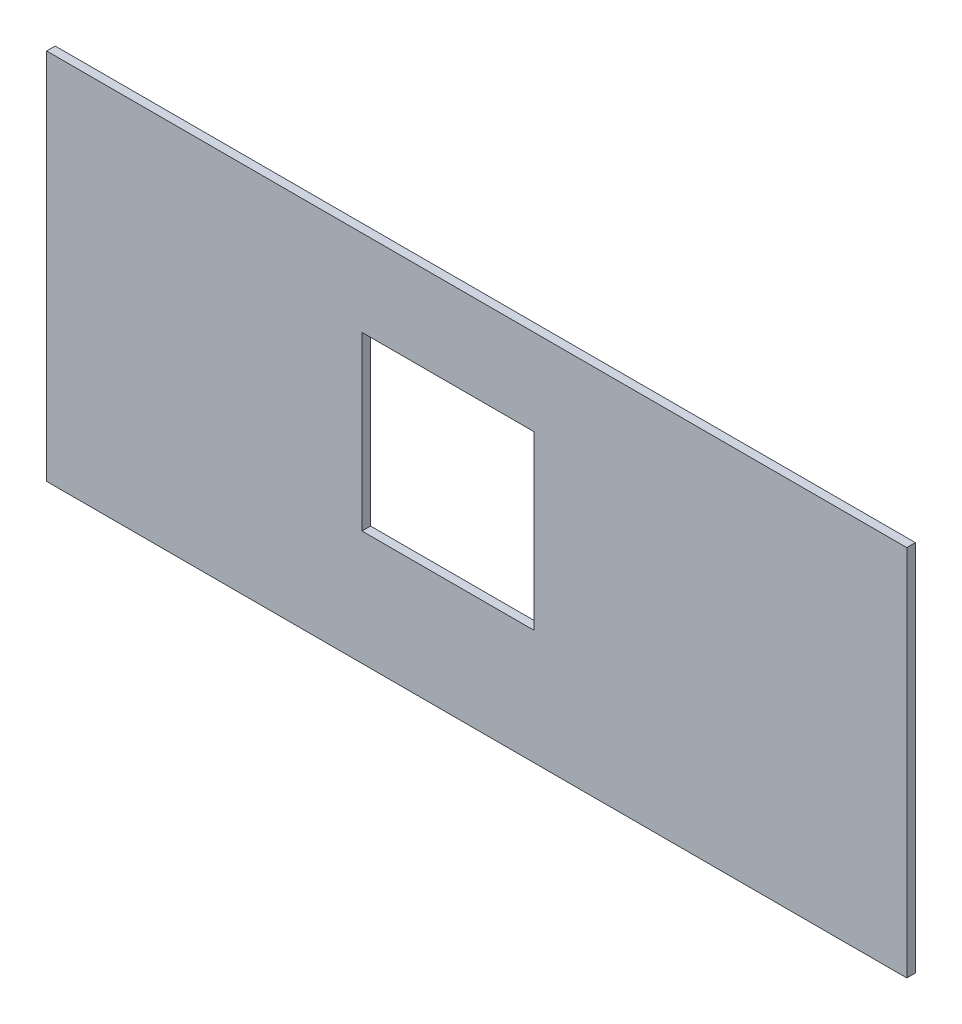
from build123d import *

# Parameters (mm, degrees)
ESQUISSE1_W      = 300
ESQUISSE1_H      = 130
ESQUISSE1_W_2    = 60
ESQUISSE1_H_2    = 60
EXTRUSION1_DEPTH = 3


with BuildPart() as part:
    # Esquisse1 → Extrusion1 (new body)
    with BuildSketch(Plane.XY):
        with Locations((150, 65)):
            Rectangle(ESQUISSE1_W, ESQUISSE1_H)
        with Locations((140, 70)):
            Rectangle(ESQUISSE1_W_2, ESQUISSE1_H_2, mode=Mode.SUBTRACT)
    extrude(amount=EXTRUSION1_DEPTH)


solid = part.part
